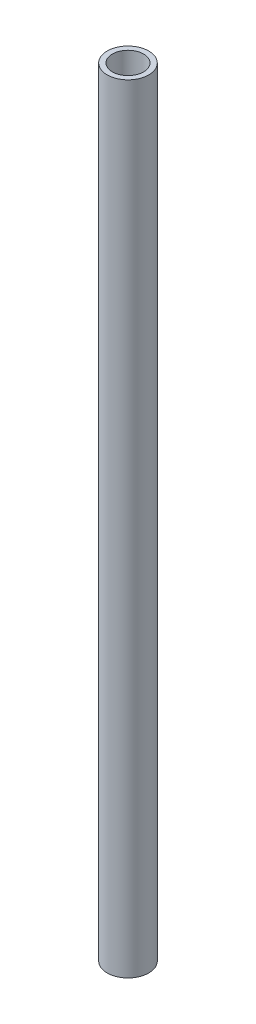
ISO-10303-21;
HEADER;
FILE_DESCRIPTION(('STEP AP214'),'2;1');
FILE_NAME('part.step','',(''),(''),'','','');
FILE_SCHEMA(('AUTOMOTIVE_DESIGN { 1 0 10303 214 1 1 1 1 }'));
ENDSEC;
DATA;
#1=APPLICATION_CONTEXT('core data for automotive mechanical design processes');
#2=APPLICATION_PROTOCOL_DEFINITION('international standard','automotive_design',2000,#1);
#3=PRODUCT_CONTEXT('',#1,'mechanical');
#4=PRODUCT('Part','Part','',(#3));
#5=PRODUCT_RELATED_PRODUCT_CATEGORY('part','',(#4));
#6=PRODUCT_DEFINITION_FORMATION('','',#4);
#7=PRODUCT_DEFINITION_CONTEXT('part definition',#1,'design');
#8=PRODUCT_DEFINITION('design','',#6,#7);
#9=PRODUCT_DEFINITION_SHAPE('','',#8);
#10=(LENGTH_UNIT() NAMED_UNIT(*) SI_UNIT(.MILLI.,.METRE.));
#11=(NAMED_UNIT(*) PLANE_ANGLE_UNIT() SI_UNIT($,.RADIAN.));
#12=(NAMED_UNIT(*) SI_UNIT($,.STERADIAN.) SOLID_ANGLE_UNIT());
#13=UNCERTAINTY_MEASURE_WITH_UNIT(LENGTH_MEASURE(1.E-05),#10,'distance_accuracy_value','');
#14=(GEOMETRIC_REPRESENTATION_CONTEXT(3) GLOBAL_UNCERTAINTY_ASSIGNED_CONTEXT((#13)) GLOBAL_UNIT_ASSIGNED_CONTEXT((#10,
#11,#12)) REPRESENTATION_CONTEXT('',''));
#15=CARTESIAN_POINT('',(0.,0.,0.));
#16=DIRECTION('',(0.,0.,1.));
#17=DIRECTION('',(1.,0.,0.));
#18=AXIS2_PLACEMENT_3D('',#15,#16,#17);
#19=CARTESIAN_POINT('',(0.,150.,0.));
#20=DIRECTION('',(0.,1.,0.));
#21=DIRECTION('',(0.,0.,1.));
#22=AXIS2_PLACEMENT_3D('',#19,#20,#21);
#23=PLANE('',#22);
#24=CARTESIAN_POINT('',(0.,150.,0.));
#25=DIRECTION('',(0.,1.,0.));
#26=DIRECTION('',(0.,0.,1.));
#27=AXIS2_PLACEMENT_3D('',#24,#25,#26);
#28=CIRCLE('',#27,4.);
#29=CARTESIAN_POINT('',(0.,150.,4.));
#30=VERTEX_POINT('',#29);
#31=EDGE_CURVE('E10',#30,#30,#28,.T.);
#32=ORIENTED_EDGE('',*,*,#31,.T.);
#33=EDGE_LOOP('',(#32));
#34=FACE_BOUND('',#33,.T.);
#35=CARTESIAN_POINT('',(0.,150.,0.));
#36=DIRECTION('',(0.,1.,0.));
#37=DIRECTION('',(0.,0.,1.));
#38=AXIS2_PLACEMENT_3D('',#35,#36,#37);
#39=CIRCLE('',#38,3.);
#40=CARTESIAN_POINT('',(0.,150.,3.));
#41=VERTEX_POINT('',#40);
#42=EDGE_CURVE('E41',#41,#41,#39,.T.);
#43=ORIENTED_EDGE('',*,*,#42,.F.);
#44=EDGE_LOOP('',(#43));
#45=FACE_BOUND('',#44,.T.);
#46=ADVANCED_FACE('F30',(#34,#45),#23,.T.);
#47=CARTESIAN_POINT('',(0.,0.,0.));
#48=DIRECTION('',(0.,1.,0.));
#49=DIRECTION('',(0.,0.,1.));
#50=AXIS2_PLACEMENT_3D('',#47,#48,#49);
#51=PLANE('',#50);
#52=CARTESIAN_POINT('',(0.,0.,0.));
#53=DIRECTION('',(0.,1.,0.));
#54=DIRECTION('',(0.,0.,1.));
#55=AXIS2_PLACEMENT_3D('',#52,#53,#54);
#56=CIRCLE('',#55,4.);
#57=CARTESIAN_POINT('',(0.,0.,4.));
#58=VERTEX_POINT('',#57);
#59=EDGE_CURVE('E34',#58,#58,#56,.T.);
#60=ORIENTED_EDGE('',*,*,#59,.F.);
#61=EDGE_LOOP('',(#60));
#62=FACE_BOUND('',#61,.T.);
#63=CARTESIAN_POINT('',(0.,0.,0.));
#64=DIRECTION('',(0.,1.,0.));
#65=DIRECTION('',(0.,0.,1.));
#66=AXIS2_PLACEMENT_3D('',#63,#64,#65);
#67=CIRCLE('',#66,3.);
#68=CARTESIAN_POINT('',(0.,0.,3.));
#69=VERTEX_POINT('',#68);
#70=EDGE_CURVE('E43',#69,#69,#67,.T.);
#71=ORIENTED_EDGE('',*,*,#70,.T.);
#72=EDGE_LOOP('',(#71));
#73=FACE_BOUND('',#72,.T.);
#74=ADVANCED_FACE('F53',(#62,#73),#51,.F.);
#75=CARTESIAN_POINT('',(0.,150.,0.));
#76=DIRECTION('',(0.,-1.,0.));
#77=DIRECTION('',(0.,0.,-1.));
#78=AXIS2_PLACEMENT_3D('',#75,#76,#77);
#79=CYLINDRICAL_SURFACE('',#78,4.);
#80=ORIENTED_EDGE('',*,*,#31,.F.);
#81=EDGE_LOOP('',(#80));
#82=FACE_BOUND('',#81,.T.);
#83=ORIENTED_EDGE('',*,*,#59,.T.);
#84=EDGE_LOOP('',(#83));
#85=FACE_BOUND('',#84,.T.);
#86=ADVANCED_FACE('F32',(#82,#85),#79,.T.);
#87=CARTESIAN_POINT('',(0.,150.,0.));
#88=DIRECTION('',(0.,-1.,0.));
#89=DIRECTION('',(0.,0.,-1.));
#90=AXIS2_PLACEMENT_3D('',#87,#88,#89);
#91=CYLINDRICAL_SURFACE('',#90,3.);
#92=ORIENTED_EDGE('',*,*,#42,.T.);
#93=EDGE_LOOP('',(#92));
#94=FACE_BOUND('',#93,.T.);
#95=ORIENTED_EDGE('',*,*,#70,.F.);
#96=EDGE_LOOP('',(#95));
#97=FACE_BOUND('',#96,.T.);
#98=ADVANCED_FACE('F49',(#94,#97),#91,.F.);
#99=CLOSED_SHELL('',(#46,#74,#86,#98));
#100=MANIFOLD_SOLID_BREP('B2',#99);
#101=ADVANCED_BREP_SHAPE_REPRESENTATION('',(#18,#100),#14);
#102=SHAPE_DEFINITION_REPRESENTATION(#9,#101);
ENDSEC;
END-ISO-10303-21;
